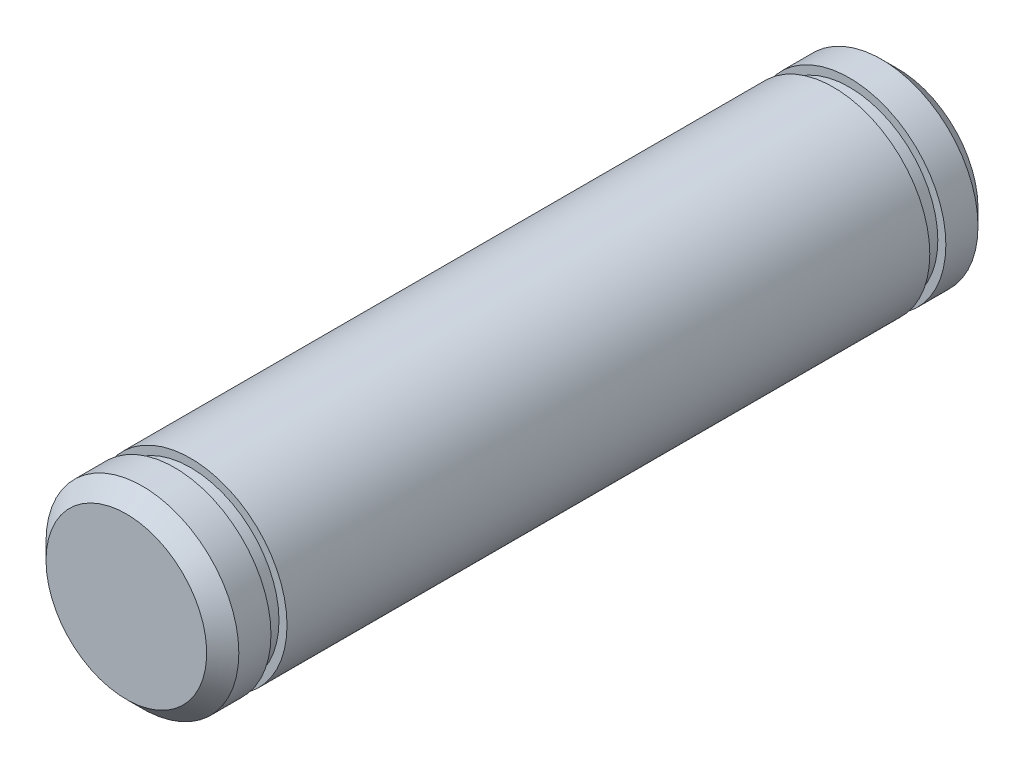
ISO-10303-21;
HEADER;
FILE_DESCRIPTION(('STEP AP214'),'2;1');
FILE_NAME('part.step','',(''),(''),'','','');
FILE_SCHEMA(('AUTOMOTIVE_DESIGN { 1 0 10303 214 1 1 1 1 }'));
ENDSEC;
DATA;
#1=APPLICATION_CONTEXT('core data for automotive mechanical design processes');
#2=APPLICATION_PROTOCOL_DEFINITION('international standard','automotive_design',2000,#1);
#3=PRODUCT_CONTEXT('',#1,'mechanical');
#4=PRODUCT('Part','Part','',(#3));
#5=PRODUCT_RELATED_PRODUCT_CATEGORY('part','',(#4));
#6=PRODUCT_DEFINITION_FORMATION('','',#4);
#7=PRODUCT_DEFINITION_CONTEXT('part definition',#1,'design');
#8=PRODUCT_DEFINITION('design','',#6,#7);
#9=PRODUCT_DEFINITION_SHAPE('','',#8);
#10=(LENGTH_UNIT() NAMED_UNIT(*) SI_UNIT(.MILLI.,.METRE.));
#11=(NAMED_UNIT(*) PLANE_ANGLE_UNIT() SI_UNIT($,.RADIAN.));
#12=(NAMED_UNIT(*) SI_UNIT($,.STERADIAN.) SOLID_ANGLE_UNIT());
#13=UNCERTAINTY_MEASURE_WITH_UNIT(LENGTH_MEASURE(1.E-05),#10,'distance_accuracy_value','');
#14=(GEOMETRIC_REPRESENTATION_CONTEXT(3) GLOBAL_UNCERTAINTY_ASSIGNED_CONTEXT((#13)) GLOBAL_UNIT_ASSIGNED_CONTEXT((#10,
#11,#12)) REPRESENTATION_CONTEXT('',''));
#15=CARTESIAN_POINT('',(0.,0.,0.));
#16=DIRECTION('',(0.,0.,1.));
#17=DIRECTION('',(1.,0.,0.));
#18=AXIS2_PLACEMENT_3D('',#15,#16,#17);
#19=CARTESIAN_POINT('',(0.,0.,0.));
#20=DIRECTION('',(0.,0.,-1.));
#21=DIRECTION('',(-1.,0.,0.));
#22=AXIS2_PLACEMENT_3D('',#19,#20,#21);
#23=PLANE('',#22);
#24=CARTESIAN_POINT('',(0.,0.,0.));
#25=DIRECTION('',(0.,0.,1.));
#26=DIRECTION('',(1.,0.,0.));
#27=AXIS2_PLACEMENT_3D('',#24,#25,#26);
#28=CIRCLE('',#27,4.99999999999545);
#29=CARTESIAN_POINT('',(4.99999999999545,0.,0.));
#30=VERTEX_POINT('',#29);
#31=EDGE_CURVE('E18',#30,#30,#28,.T.);
#32=ORIENTED_EDGE('',*,*,#31,.F.);
#33=EDGE_LOOP('',(#32));
#34=FACE_BOUND('',#33,.T.);
#35=ADVANCED_FACE('F14',(#34),#23,.T.);
#36=CARTESIAN_POINT('',(0.,0.,48.));
#37=DIRECTION('',(0.,0.,-1.));
#38=DIRECTION('',(-1.,0.,0.));
#39=AXIS2_PLACEMENT_3D('',#36,#37,#38);
#40=PLANE('',#39);
#41=CARTESIAN_POINT('',(0.,0.,47.999999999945));
#42=DIRECTION('',(0.,0.,-1.));
#43=DIRECTION('',(-1.,0.,0.));
#44=AXIS2_PLACEMENT_3D('',#41,#42,#43);
#45=CIRCLE('',#44,4.99999999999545);
#46=CARTESIAN_POINT('',(-4.99999999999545,0.,47.999999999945));
#47=VERTEX_POINT('',#46);
#48=EDGE_CURVE('E50',#47,#47,#45,.T.);
#49=ORIENTED_EDGE('',*,*,#48,.F.);
#50=EDGE_LOOP('',(#49));
#51=FACE_BOUND('',#50,.T.);
#52=ADVANCED_FACE('F62',(#51),#40,.F.);
#53=CARTESIAN_POINT('',(0.,0.,0.999999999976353));
#54=DIRECTION('',(0.,0.,1.));
#55=DIRECTION('',(1.,0.,0.));
#56=AXIS2_PLACEMENT_3D('',#53,#54,#55);
#57=CONICAL_SURFACE('',#56,5.99999999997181,0.785398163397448);
#58=ORIENTED_EDGE('',*,*,#31,.T.);
#59=EDGE_LOOP('',(#58));
#60=FACE_BOUND('',#59,.T.);
#61=CARTESIAN_POINT('',(0.,0.,1.));
#62=DIRECTION('',(0.,0.,1.));
#63=DIRECTION('',(1.,0.,0.));
#64=AXIS2_PLACEMENT_3D('',#61,#62,#63);
#65=CIRCLE('',#64,6.);
#66=CARTESIAN_POINT('',(6.,0.,1.));
#67=VERTEX_POINT('',#66);
#68=EDGE_CURVE('E30',#67,#67,#65,.T.);
#69=ORIENTED_EDGE('',*,*,#68,.F.);
#70=EDGE_LOOP('',(#69));
#71=FACE_BOUND('',#70,.T.);
#72=ADVANCED_FACE('F58',(#60,#71),#57,.T.);
#73=CARTESIAN_POINT('',(0.,0.,46.9999999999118));
#74=DIRECTION('',(0.,0.,-1.));
#75=DIRECTION('',(-1.,0.,0.));
#76=AXIS2_PLACEMENT_3D('',#73,#74,#75);
#77=CONICAL_SURFACE('',#76,6.00000000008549,0.78539816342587);
#78=CARTESIAN_POINT('',(0.,0.,47.));
#79=DIRECTION('',(0.,0.,1.));
#80=DIRECTION('',(1.,0.,0.));
#81=AXIS2_PLACEMENT_3D('',#78,#79,#80);
#82=CIRCLE('',#81,6.);
#83=CARTESIAN_POINT('',(6.,0.,47.));
#84=VERTEX_POINT('',#83);
#85=EDGE_CURVE('E49',#84,#84,#82,.F.);
#86=ORIENTED_EDGE('',*,*,#85,.F.);
#87=EDGE_LOOP('',(#86));
#88=FACE_BOUND('',#87,.T.);
#89=ORIENTED_EDGE('',*,*,#48,.T.);
#90=EDGE_LOOP('',(#89));
#91=FACE_BOUND('',#90,.T.);
#92=ADVANCED_FACE('F121',(#88,#91),#77,.T.);
#93=CARTESIAN_POINT('',(0.,0.,0.));
#94=DIRECTION('',(0.,0.,1.));
#95=DIRECTION('',(1.,0.,0.));
#96=AXIS2_PLACEMENT_3D('',#93,#94,#95);
#97=CYLINDRICAL_SURFACE('',#96,6.);
#98=ORIENTED_EDGE('',*,*,#68,.T.);
#99=EDGE_LOOP('',(#98));
#100=FACE_BOUND('',#99,.T.);
#101=CARTESIAN_POINT('',(0.,0.,3.));
#102=DIRECTION('',(0.,0.,1.));
#103=DIRECTION('',(1.,0.,0.));
#104=AXIS2_PLACEMENT_3D('',#101,#102,#103);
#105=CIRCLE('',#104,6.);
#106=CARTESIAN_POINT('',(6.,0.,3.));
#107=VERTEX_POINT('',#106);
#108=EDGE_CURVE('E47',#107,#107,#105,.F.);
#109=ORIENTED_EDGE('',*,*,#108,.T.);
#110=EDGE_LOOP('',(#109));
#111=FACE_BOUND('',#110,.T.);
#112=ADVANCED_FACE('F101',(#100,#111),#97,.T.);
#113=CARTESIAN_POINT('',(0.,0.,0.));
#114=DIRECTION('',(0.,0.,1.));
#115=DIRECTION('',(1.,0.,0.));
#116=AXIS2_PLACEMENT_3D('',#113,#114,#115);
#117=CYLINDRICAL_SURFACE('',#116,6.);
#118=CARTESIAN_POINT('',(0.,0.,45.));
#119=DIRECTION('',(0.,0.,1.));
#120=DIRECTION('',(1.,0.,0.));
#121=AXIS2_PLACEMENT_3D('',#118,#119,#120);
#122=CIRCLE('',#121,6.);
#123=CARTESIAN_POINT('',(6.,0.,45.));
#124=VERTEX_POINT('',#123);
#125=EDGE_CURVE('E44',#124,#124,#122,.F.);
#126=ORIENTED_EDGE('',*,*,#125,.F.);
#127=EDGE_LOOP('',(#126));
#128=FACE_BOUND('',#127,.T.);
#129=ORIENTED_EDGE('',*,*,#85,.T.);
#130=EDGE_LOOP('',(#129));
#131=FACE_BOUND('',#130,.T.);
#132=ADVANCED_FACE('F93',(#128,#131),#117,.T.);
#133=CARTESIAN_POINT('',(0.,0.,3.));
#134=DIRECTION('',(0.,0.,-1.));
#135=DIRECTION('',(-1.,0.,0.));
#136=AXIS2_PLACEMENT_3D('',#133,#134,#135);
#137=PLANE('',#136);
#138=ORIENTED_EDGE('',*,*,#108,.F.);
#139=EDGE_LOOP('',(#138));
#140=FACE_BOUND('',#139,.T.);
#141=CARTESIAN_POINT('',(0.,0.,3.));
#142=DIRECTION('',(0.,0.,1.));
#143=DIRECTION('',(1.,0.,0.));
#144=AXIS2_PLACEMENT_3D('',#141,#142,#143);
#145=CIRCLE('',#144,5.5);
#146=CARTESIAN_POINT('',(5.5,0.,3.));
#147=VERTEX_POINT('',#146);
#148=EDGE_CURVE('E41',#147,#147,#145,.T.);
#149=ORIENTED_EDGE('',*,*,#148,.F.);
#150=EDGE_LOOP('',(#149));
#151=FACE_BOUND('',#150,.T.);
#152=ADVANCED_FACE('F91',(#140,#151),#137,.F.);
#153=CARTESIAN_POINT('',(0.,0.,45.));
#154=DIRECTION('',(0.,0.,-1.));
#155=DIRECTION('',(-1.,0.,0.));
#156=AXIS2_PLACEMENT_3D('',#153,#154,#155);
#157=PLANE('',#156);
#158=ORIENTED_EDGE('',*,*,#125,.T.);
#159=EDGE_LOOP('',(#158));
#160=FACE_BOUND('',#159,.T.);
#161=CARTESIAN_POINT('',(0.,0.,45.));
#162=DIRECTION('',(0.,0.,-1.));
#163=DIRECTION('',(-1.,0.,0.));
#164=AXIS2_PLACEMENT_3D('',#161,#162,#163);
#165=CIRCLE('',#164,5.5);
#166=CARTESIAN_POINT('',(-5.5,0.,45.));
#167=VERTEX_POINT('',#166);
#168=EDGE_CURVE('E38',#167,#167,#165,.T.);
#169=ORIENTED_EDGE('',*,*,#168,.F.);
#170=EDGE_LOOP('',(#169));
#171=FACE_BOUND('',#170,.T.);
#172=ADVANCED_FACE('F87',(#160,#171),#157,.T.);
#173=CARTESIAN_POINT('',(0.,0.,3.));
#174=DIRECTION('',(0.,0.,1.));
#175=DIRECTION('',(1.,0.,0.));
#176=AXIS2_PLACEMENT_3D('',#173,#174,#175);
#177=CYLINDRICAL_SURFACE('',#176,5.5);
#178=CARTESIAN_POINT('',(0.,0.,4.));
#179=DIRECTION('',(0.,0.,1.));
#180=DIRECTION('',(1.,0.,0.));
#181=AXIS2_PLACEMENT_3D('',#178,#179,#180);
#182=CIRCLE('',#181,5.5);
#183=CARTESIAN_POINT('',(5.5,0.,4.));
#184=VERTEX_POINT('',#183);
#185=EDGE_CURVE('E35',#184,#184,#182,.T.);
#186=ORIENTED_EDGE('',*,*,#185,.F.);
#187=EDGE_LOOP('',(#186));
#188=FACE_BOUND('',#187,.T.);
#189=ORIENTED_EDGE('',*,*,#148,.T.);
#190=EDGE_LOOP('',(#189));
#191=FACE_BOUND('',#190,.T.);
#192=ADVANCED_FACE('F84',(#188,#191),#177,.T.);
#193=CARTESIAN_POINT('',(0.,0.,45.));
#194=DIRECTION('',(0.,0.,-1.));
#195=DIRECTION('',(-1.,0.,0.));
#196=AXIS2_PLACEMENT_3D('',#193,#194,#195);
#197=CYLINDRICAL_SURFACE('',#196,5.5);
#198=ORIENTED_EDGE('',*,*,#168,.T.);
#199=EDGE_LOOP('',(#198));
#200=FACE_BOUND('',#199,.T.);
#201=CARTESIAN_POINT('',(0.,0.,44.));
#202=DIRECTION('',(0.,0.,-1.));
#203=DIRECTION('',(-1.,0.,0.));
#204=AXIS2_PLACEMENT_3D('',#201,#202,#203);
#205=CIRCLE('',#204,5.5);
#206=CARTESIAN_POINT('',(-5.5,0.,44.));
#207=VERTEX_POINT('',#206);
#208=EDGE_CURVE('E27',#207,#207,#205,.F.);
#209=ORIENTED_EDGE('',*,*,#208,.T.);
#210=EDGE_LOOP('',(#209));
#211=FACE_BOUND('',#210,.T.);
#212=ADVANCED_FACE('F80',(#200,#211),#197,.T.);
#213=CARTESIAN_POINT('',(0.,0.,4.));
#214=DIRECTION('',(0.,0.,-1.));
#215=DIRECTION('',(-1.,0.,0.));
#216=AXIS2_PLACEMENT_3D('',#213,#214,#215);
#217=PLANE('',#216);
#218=CARTESIAN_POINT('',(0.,0.,4.));
#219=DIRECTION('',(0.,0.,1.));
#220=DIRECTION('',(1.,0.,0.));
#221=AXIS2_PLACEMENT_3D('',#218,#219,#220);
#222=CIRCLE('',#221,6.);
#223=CARTESIAN_POINT('',(6.,0.,4.));
#224=VERTEX_POINT('',#223);
#225=EDGE_CURVE('E22',#224,#224,#222,.T.);
#226=ORIENTED_EDGE('',*,*,#225,.F.);
#227=EDGE_LOOP('',(#226));
#228=FACE_BOUND('',#227,.T.);
#229=ORIENTED_EDGE('',*,*,#185,.T.);
#230=EDGE_LOOP('',(#229));
#231=FACE_BOUND('',#230,.T.);
#232=ADVANCED_FACE('F74',(#228,#231),#217,.T.);
#233=CARTESIAN_POINT('',(0.,0.,44.));
#234=DIRECTION('',(0.,0.,-1.));
#235=DIRECTION('',(-1.,0.,0.));
#236=AXIS2_PLACEMENT_3D('',#233,#234,#235);
#237=PLANE('',#236);
#238=CARTESIAN_POINT('',(0.,0.,44.));
#239=DIRECTION('',(0.,0.,1.));
#240=DIRECTION('',(1.,0.,0.));
#241=AXIS2_PLACEMENT_3D('',#238,#239,#240);
#242=CIRCLE('',#241,6.);
#243=CARTESIAN_POINT('',(6.,0.,44.));
#244=VERTEX_POINT('',#243);
#245=EDGE_CURVE('E9',#244,#244,#242,.F.);
#246=ORIENTED_EDGE('',*,*,#245,.F.);
#247=EDGE_LOOP('',(#246));
#248=FACE_BOUND('',#247,.T.);
#249=ORIENTED_EDGE('',*,*,#208,.F.);
#250=EDGE_LOOP('',(#249));
#251=FACE_BOUND('',#250,.T.);
#252=ADVANCED_FACE('F70',(#248,#251),#237,.F.);
#253=CARTESIAN_POINT('',(0.,0.,0.));
#254=DIRECTION('',(0.,0.,1.));
#255=DIRECTION('',(1.,0.,0.));
#256=AXIS2_PLACEMENT_3D('',#253,#254,#255);
#257=CYLINDRICAL_SURFACE('',#256,6.);
#258=ORIENTED_EDGE('',*,*,#225,.T.);
#259=EDGE_LOOP('',(#258));
#260=FACE_BOUND('',#259,.T.);
#261=ORIENTED_EDGE('',*,*,#245,.T.);
#262=EDGE_LOOP('',(#261));
#263=FACE_BOUND('',#262,.T.);
#264=ADVANCED_FACE('F16',(#260,#263),#257,.T.);
#265=CLOSED_SHELL('',(#35,#52,#72,#92,#112,#132,#152,#172,#192,#212,#232,#252,#264));
#266=MANIFOLD_SOLID_BREP('B1',#265);
#267=ADVANCED_BREP_SHAPE_REPRESENTATION('',(#18,#266),#14);
#268=SHAPE_DEFINITION_REPRESENTATION(#9,#267);
ENDSEC;
END-ISO-10303-21;
